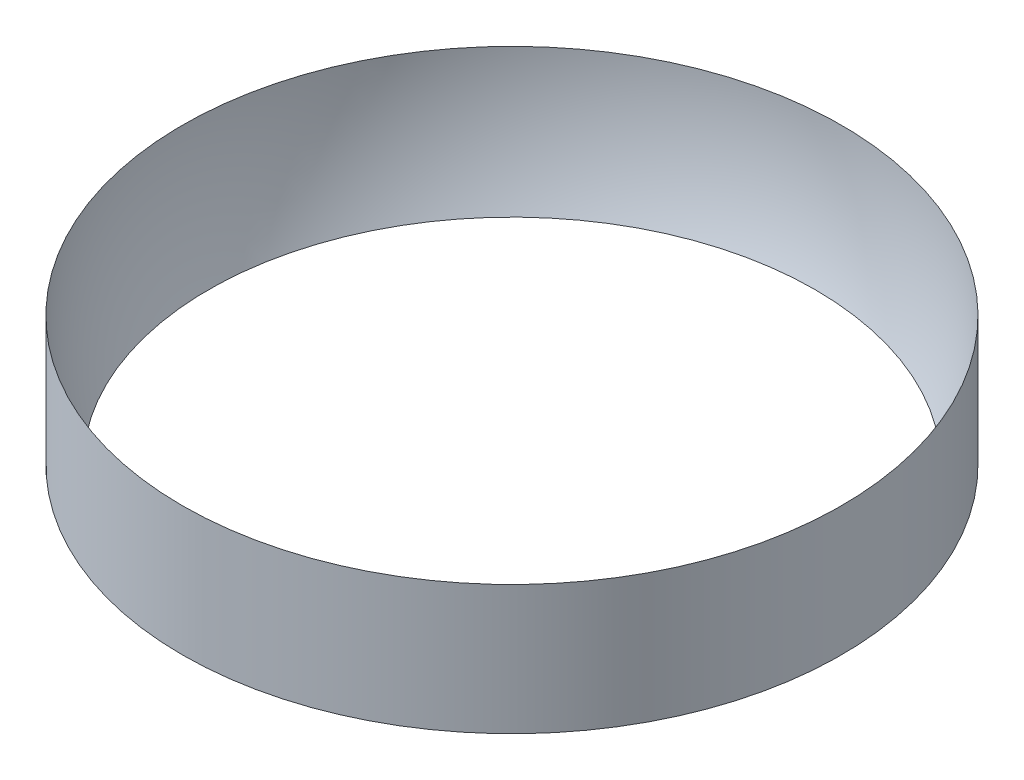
ISO-10303-21;
HEADER;
FILE_DESCRIPTION(('STEP AP214'),'2;1');
FILE_NAME('part.step','',(''),(''),'','','');
FILE_SCHEMA(('AUTOMOTIVE_DESIGN { 1 0 10303 214 1 1 1 1 }'));
ENDSEC;
DATA;
#1=APPLICATION_CONTEXT('core data for automotive mechanical design processes');
#2=APPLICATION_PROTOCOL_DEFINITION('international standard','automotive_design',2000,#1);
#3=PRODUCT_CONTEXT('',#1,'mechanical');
#4=PRODUCT('Part','Part','',(#3));
#5=PRODUCT_RELATED_PRODUCT_CATEGORY('part','',(#4));
#6=PRODUCT_DEFINITION_FORMATION('','',#4);
#7=PRODUCT_DEFINITION_CONTEXT('part definition',#1,'design');
#8=PRODUCT_DEFINITION('design','',#6,#7);
#9=PRODUCT_DEFINITION_SHAPE('','',#8);
#10=(LENGTH_UNIT() NAMED_UNIT(*) SI_UNIT(.MILLI.,.METRE.));
#11=(NAMED_UNIT(*) PLANE_ANGLE_UNIT() SI_UNIT($,.RADIAN.));
#12=(NAMED_UNIT(*) SI_UNIT($,.STERADIAN.) SOLID_ANGLE_UNIT());
#13=UNCERTAINTY_MEASURE_WITH_UNIT(LENGTH_MEASURE(1.E-05),#10,'distance_accuracy_value','');
#14=(GEOMETRIC_REPRESENTATION_CONTEXT(3) GLOBAL_UNCERTAINTY_ASSIGNED_CONTEXT((#13)) GLOBAL_UNIT_ASSIGNED_CONTEXT((#10,
#11,#12)) REPRESENTATION_CONTEXT('',''));
#15=CARTESIAN_POINT('',(0.,0.,0.));
#16=DIRECTION('',(0.,0.,1.));
#17=DIRECTION('',(1.,0.,0.));
#18=AXIS2_PLACEMENT_3D('',#15,#16,#17);
#19=CARTESIAN_POINT('',(0.,2.54,0.));
#20=DIRECTION('',(0.,-1.,0.));
#21=DIRECTION('',(0.,0.,-1.));
#22=AXIS2_PLACEMENT_3D('',#19,#20,#21);
#23=CYLINDRICAL_SURFACE('',#22,6.477);
#24=CARTESIAN_POINT('',(0.,2.54,0.));
#25=DIRECTION('',(0.,1.,0.));
#26=DIRECTION('',(0.,0.,1.));
#27=AXIS2_PLACEMENT_3D('',#24,#25,#26);
#28=CIRCLE('',#27,6.477);
#29=CARTESIAN_POINT('',(0.,2.54,6.477));
#30=VERTEX_POINT('',#29);
#31=EDGE_CURVE('E51',#30,#30,#28,.T.);
#32=ORIENTED_EDGE('',*,*,#31,.F.);
#33=EDGE_LOOP('',(#32));
#34=FACE_BOUND('',#33,.T.);
#35=CARTESIAN_POINT('',(0.,0.,0.));
#36=DIRECTION('',(0.,1.,0.));
#37=DIRECTION('',(0.,0.,1.));
#38=AXIS2_PLACEMENT_3D('',#35,#36,#37);
#39=CIRCLE('',#38,6.477);
#40=CARTESIAN_POINT('',(0.,0.,6.477));
#41=VERTEX_POINT('',#40);
#42=EDGE_CURVE('E10',#41,#41,#39,.T.);
#43=ORIENTED_EDGE('',*,*,#42,.T.);
#44=EDGE_LOOP('',(#43));
#45=FACE_BOUND('',#44,.T.);
#46=ADVANCED_FACE('F43',(#34,#45),#23,.T.);
#47=CARTESIAN_POINT('',(0.,0.,0.));
#48=DIRECTION('',(0.,1.,0.));
#49=DIRECTION('',(0.,0.,1.));
#50=AXIS2_PLACEMENT_3D('',#47,#48,#49);
#51=PLANE('',#50);
#52=CARTESIAN_POINT('',(0.,0.,0.));
#53=DIRECTION('',(0.,1.,0.));
#54=DIRECTION('',(0.,0.,1.));
#55=AXIS2_PLACEMENT_3D('',#52,#53,#54);
#56=CIRCLE('',#55,5.95818168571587);
#57=CARTESIAN_POINT('',(0.,0.,5.95818168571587));
#58=VERTEX_POINT('',#57);
#59=EDGE_CURVE('E46',#58,#58,#56,.T.);
#60=ORIENTED_EDGE('',*,*,#59,.T.);
#61=EDGE_LOOP('',(#60));
#62=FACE_BOUND('',#61,.T.);
#63=ORIENTED_EDGE('',*,*,#42,.F.);
#64=EDGE_LOOP('',(#63));
#65=FACE_BOUND('',#64,.T.);
#66=ADVANCED_FACE('F63',(#62,#65),#51,.F.);
#67=CARTESIAN_POINT('',(0.,2.54,0.));
#68=DIRECTION('',(0.,0.,1.));
#69=DIRECTION('',(-1.,0.,0.));
#70=AXIS2_PLACEMENT_3D('',#67,#68,#69);
#71=SPHERICAL_SURFACE('',#70,6.477);
#72=CARTESIAN_POINT('',(0.,2.54,0.));
#73=DIRECTION('',(0.,1.,0.));
#74=DIRECTION('',(0.,0.,1.));
#75=AXIS2_PLACEMENT_3D('',#72,#73,#74);
#76=SPHERICAL_SURFACE('',#75,6.477);
#77=ORIENTED_EDGE('',*,*,#31,.T.);
#78=EDGE_LOOP('',(#77));
#79=FACE_BOUND('',#78,.T.);
#80=ORIENTED_EDGE('',*,*,#59,.F.);
#81=EDGE_LOOP('',(#80));
#82=FACE_BOUND('',#81,.T.);
#83=ADVANCED_FACE('F66',(#79,#82),#76,.F.);
#84=CLOSED_SHELL('',(#46,#66,#83));
#85=MANIFOLD_SOLID_BREP('B2',#84);
#86=ADVANCED_BREP_SHAPE_REPRESENTATION('',(#18,#85),#14);
#87=SHAPE_DEFINITION_REPRESENTATION(#9,#86);
ENDSEC;
END-ISO-10303-21;
